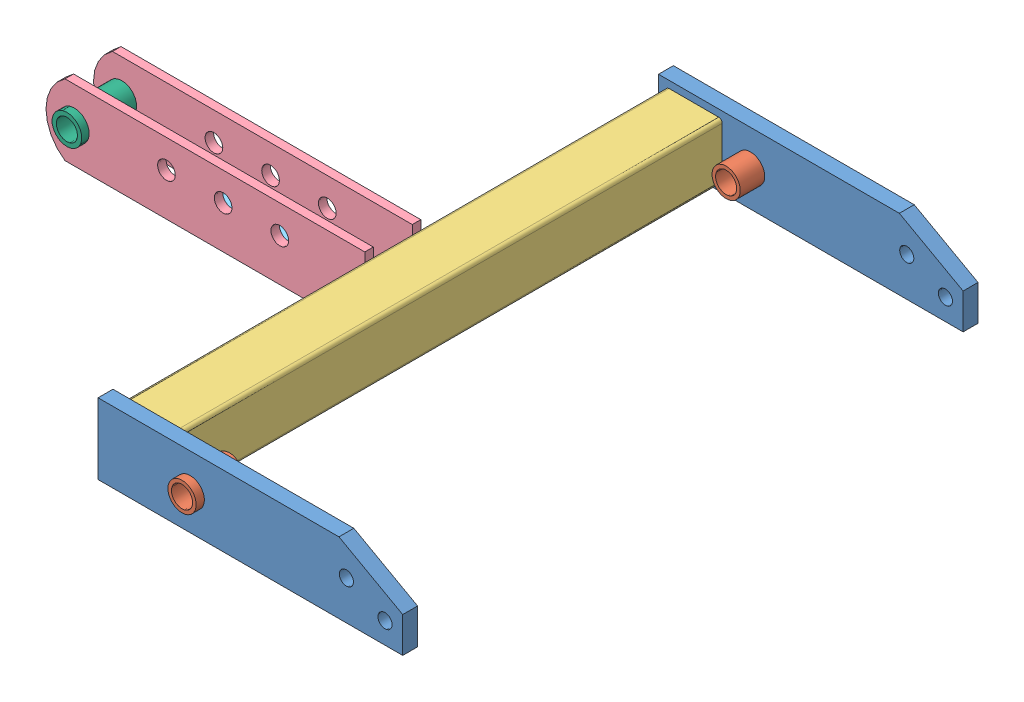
SolidWorks assembly 3 point AR 16.SLDASM, configuration Défaut (file format 3100). Lengths in mm.
Overall size (870 100 835).
9 component instances, 6 part files, 24 mates.
Components (placement in the parent):
- plaque laterale-1: plaque laterale.SLDPRT [Défaut] at origin size (430 100 21)
- palier bas-1: palier bas.SLDPRT [Défaut] at (130 -50 -34.5) size (40 40 67)
- traverse-1: traverse.SLDPRT [Défaut] at (10 -10 -770) size (80 80 770)
- plaque laterale-2: plaque laterale.SLDPRT [Défaut] at (0 0 -791) size (430 100 21)
- palier bas-2: palier bas.SLDPRT [Défaut] at (130 -50 -802.5) x (-0.185863 0.982576 0) z (0 0 1) size (40 40 67)
- plaque haute-1: plaque haute.SLDPRT [Défaut] at (10 0 -345.5) x (-1 0 0) z (0 0 -1) size (450 100 12)
- plaque haute-2: plaque haute.SLDPRT [Défaut] at (10 0 -412.5) x (-1 0 0) z (0 0 -1) size (450 100 12)
- renfort arriere-1: renfort arriere.SLDPRT [Défaut] at (10 -100 -412.5) x (-1 0 0) z (0 -1 0) size (305.62 55 10)
- entretoise port1-1: entretoise port1.SLDPRT [Défaut] at (-400 -50 -435) x (-0.528577 -0.848885 0) z (0 0 1) size (42 42 100)
Mates (geometry in assembly coordinates):
- Coïncidente1: coincident anti-aligned: plane of plaque laterale-1 through (0 -100 0) normal (0 0 -1); plane of traverse-1 through (10 -90 0) normal (0 0 1)
- Parallèle1: parallel aligned: plane of plaque laterale-1 through (0 -100 21) normal (0 -1 0); plane of traverse-1 through (10 -90 0) normal (0 -1 0)
- Distance1: distance = 10 mm: line of plaque laterale-1; plane of traverse-1 through (10 -90 0) normal (0 -1 0)
- Distance2: distance = 10 mm aligned: plane of plaque laterale-1 through (0 0 21) normal (-1 0 0); plane of traverse-1 through (10 -10 0) normal (-1 0 0)
- Distance4: distance = 10 mm: plane of traverse-1 through (10 -10 0) normal (-1 0 0); line of plaque laterale-2
- Coïncidente5: coincident anti-aligned: plane of traverse-1 through (10 -90 -770) normal (0 0 -1); plane of plaque laterale-2 through (0 -100 -770) normal (0 0 1)
- Distance7: distance = 10 mm: plane of traverse-1 through (10 -90 0) normal (0 -1 0); line of plaque laterale-2
- Coaxiale1: concentric aligned: cylinder of plaque laterale-1; cylinder of palier bas-1
- Distance8: distance = 11.5 mm aligned: plane of plaque laterale-1 through (0 -100 21) normal (0 0 1); plane of palier bas-1 through (130 -50 32.5) normal (0 0 1)
- Coaxiale2: concentric aligned: cylinder of plaque laterale-2; cylinder of palier bas-2
- Distance10: distance = 11.5 mm aligned: plane of plaque laterale-2 through (0 -100 -791) normal (0 0 -1); plane of palier bas-2 through (130 -50 -802.5) normal (0 0 -1)
- Parallèle2: parallel aligned: plane of plaque laterale-2 through (0 -100 -791) normal (0 0 -1); plane of plaque haute-1 through (-380 -50 -357.5) normal (0 0 -1)
- Coïncidente15: coincident aligned: plane of plaque laterale-2 through (0 0 -770) normal (0 1 0); plane of plaque haute-1 through (10 0 -357.5) normal (0 1 0)
- Distance11: distance = 27.5 mm: line of plaque haute-1; line of assembly
- Coïncidente17: coincident anti-aligned: plane of traverse-1 through (10 -10 0) normal (-1 0 0); plane of plaque haute-2 through (10 0 -424.5) normal (1 0 0)
- Coïncidente18: coincident aligned: plane of plaque haute-2 through (10 -100 -424.5) normal (0 -1 0); plane of plaque laterale-2 through (0 -100 -770) normal (0 -1 0)
- Coïncidente19: coincident anti-aligned: plane of traverse-1 through (10 -10 0) normal (-1 0 0); plane of plaque haute-1 through (10 0 -357.5) normal (1 0 0)
- Sur place1: in place: plane of plaque haute-2 through (10 -100 -424.5) normal (0 -1 0); plane of renfort arriere-1; moOrthogonalPlaneRef_w of plaque haute-2; plane of renfort arriere-1; moOrthogonalPlaneRef_w of plaque haute-2; plane of renfort arriere-1
- Coïncidente20: coincident aligned: plane of plaque haute-2; plane of renfort arriere-1
- Coïncidente21: coincident aligned: moOrthogonalPlaneRef_w of plaque haute-2; plane of renfort arriere-1
- Coïncidente22: coincident anti-aligned: moOrthogonalPlaneRef_w of plaque haute-2; plane of renfort arriere-1
- Distance13: distance = 27.5 mm: line of plaque haute-2; line of assembly
- Coaxiale3: concentric anti-aligned: cylinder of plaque haute-2; cylinder of entretoise port1-1
- Distance14: distance = 10.5 mm aligned: unknown of plaque haute-1; unknown of entretoise port1-1
